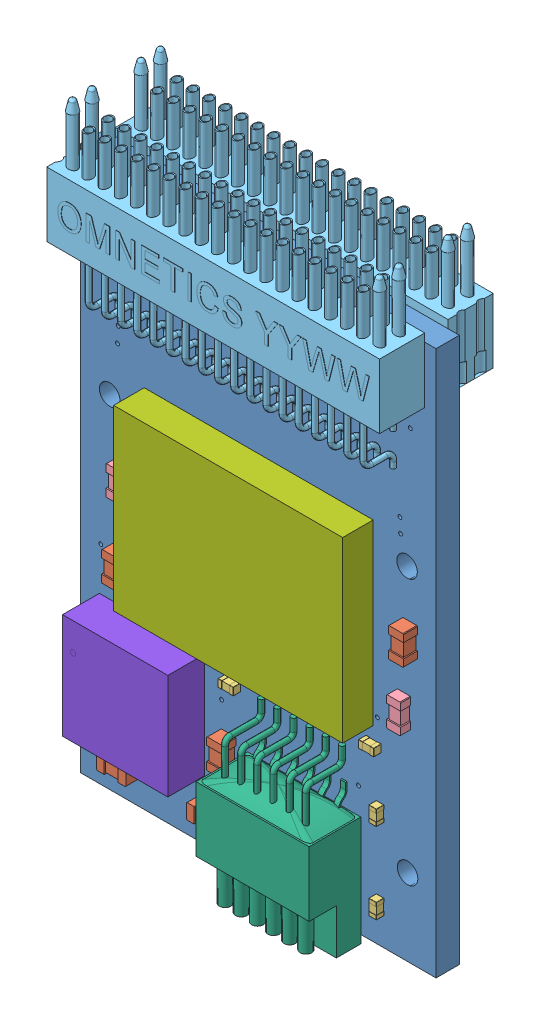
SolidWorks assembly RHD2164_accel_BGA.SLDASM, configuration Default (file format 15000). Lengths in mm.
Overall size (13.97 24.42 4.89).
17 component instances, 8 part files, 35 mates.
Components (placement in the parent):
- RHD2164_accel_bga_PCB-1: RHD2164_accel_bga_PCB.SLDPRT [Default] at origin size (13.97 21.42 0.91)
- 0402c_2320560-1: 0402c_2320560.sldprt [Default] at (12.9413 11.049 0.9144) x (0 1 0) z (0 0 1) size (1.15 0.6 0.55)
- 0402c_2320560-2: 0402c_2320560.sldprt [Default] at (1.6674 7.9992 0.9144) x (0 1 0) z (0 0 1) size (1.15 0.6 0.55)
- 0201c-1: 0201c.sldprt [0201] at (11.5189 6.7437 1.0644) size (0.6 0.3 0.3)
- 0402c_2320560-3: 0402c_2320560.sldprt [Default] at (1.7508 1.254 0.9144) size (1.15 0.6 0.55)
- 0402c_2320560-4: 0402c_2320560.sldprt [Default] at (5.801 3.6848 0.9144) x (0 -1 0) z (0 0 1) size (1.15 0.6 0.55)
- 0402c_2320560-5: 0402c_2320560.sldprt [Default] at (5.2814 1.331 0.9144) size (1.15 0.6 0.55)
- 0402r_1430758-1: 0402r_1430758.sldprt [Default] at (1.6637 10.8585 0.9144) x (0 1 0) z (0 0 1) size (1.15 0.55 0.4)
- 0402r_1430758-2: 0402r_1430758.sldprt [Default] at (12.7 8.509 0.9144) x (0 -1 0) z (0 0 1) size (1.15 0.55 0.4)
- 0201c-2: 0201c.sldprt [0201] at (5.9944 6.0579 1.0644) size (0.6 0.3 0.3)
- 0201c-3: 0201c.sldprt [0201] at (11.7729 1.397 1.0644) x (0 1 0) z (0 0 1) size (0.6 0.3 0.3)
- 0201c-4: 0201c.sldprt [0201] at (11.7729 4.572 1.0644) x (0 1 0) z (0 0 1) size (0.6 0.3 0.3)
- A79025-001-1: A79025-001.SLDPRT [Default] at (5.715 20.4672 2.6924) size (13.15 7.44 2.12)
- A79025-001-2: A79025-001.SLDPRT [Default] at (8.255 20.4672 -1.778) x (-1 0 0) z (0 0 -1) size (13.15 7.44 2.12)
- A79623-001-1: A79623-001.SLDPRT [Default] at (8.7884 4.0005 0.9144) x (1 0.000991 0) z (0.000991 -1 0) size (4.45 2.05 6.53)
- RHD2164_bga-1: RHD2164_bga.SLDPRT [Default] at (6.9977 10.8585 0.9144) size (9 7 1.2)
- ADXL335-1: ADXL335.SLDPRT [Default] at (2.8048 4.4074 0.8634) size (4.14 4.14 1.5)
Mates (geometry in assembly coordinates):
- Coincident1: coincident anti-aligned: plane of RHD2164_accel_bga-1 through (0 0 0.9144) normal (0 0 1); plane of RHD2164_bga-1 through (6.9977 10.8585 0.9144) normal (0 0 -1)
- Parallel1: parallel aligned: plane of RHD2164_accel_bga-1 through (13.97 21.4249 0.9144) normal (1 0 0); plane of RHD2164_bga-1 through (11.4977 7.3585 2.1144) normal (1 0 0)
- Coincident2: coincident anti-aligned: plane of RHD2164_accel_bga-1 through (0 0 0.9144) normal (0 0 1); plane of 0402r_1430758-1 through (0.8387 10.8585 0.9144) normal (0 0 -1)
- Parallel2: parallel aligned: plane of RHD2164_accel_bga-1 through (13.97 0 0.9144) normal (0 -1 0); plane of 0402r_1430758-1 through (1.4137 10.2835 1.3144) normal (0 -1 0)
- Coincident4: coincident anti-aligned: plane of RHD2164_accel_bga-1 through (0 0 0.9144) normal (0 0 1); plane of 0402c_2320560-2 through (0.8174 7.9992 0.9144) normal (0 0 -1)
- Parallel3: parallel aligned: plane of RHD2164_accel_bga-1 through (13.97 0 0.9144) normal (0 -1 0); plane of 0402c_2320560-2 through (1.3924 7.4242 1.4644) normal (0 -1 0)
- Coincident8: coincident aligned: plane of RHD2164_accel_bga-1 through (0 0 0.9144) normal (0 0 1); plane of ADXL335-1 through (0.7348 3.9044 0.9144) normal (0 0 1)
- Parallel4: parallel aligned: plane of RHD2164_accel_bga-1 through (13.97 0 0.9144) normal (0 -1 0); plane of ADXL335-1 through (0.7348 2.3374 0.9144) normal (0 -1 0)
- Coincident9: coincident anti-aligned: plane of RHD2164_accel_bga-1 through (0 0 0.9144) normal (0 0 1); plane of 0402c_2320560-3 through (1.7508 2.104 0.9144) normal (0 0 -1)
- Parallel5: parallel aligned: plane of RHD2164_accel_bga-1 through (0 0 0.9144) normal (-1 0 0); plane of 0402c_2320560-3 through (1.1758 1.529 1.4644) normal (-1 0 0)
- Coincident11: coincident anti-aligned: plane of RHD2164_accel_bga-1 through (0 0 0.9144) normal (0 0 1); plane of 0402c_2320560-5 through (5.2814 2.181 0.9144) normal (0 0 -1)
- Parallel6: parallel aligned: plane of RHD2164_accel_bga-1 through (0 0 0.9144) normal (-1 0 0); plane of 0402c_2320560-5 through (4.7064 1.606 1.4644) normal (-1 0 0)
- Coincident13: coincident anti-aligned: plane of RHD2164_accel_bga-1 through (0 0 0.9144) normal (0 0 1); plane of 0402c_2320560-4 through (6.651 3.6848 0.9144) normal (0 0 -1)
- Parallel7: parallel aligned: plane of RHD2164_accel_bga-1 through (13.97 0 0.9144) normal (0 -1 0); plane of 0402c_2320560-4 through (5.526 3.1098 1.4644) normal (0 -1 0)
- Coincident15: coincident anti-aligned: plane of RHD2164_accel_bga-1 through (0 0 0.9144) normal (0 0 1); plane of 0201c-2 through (6.2944 6.2079 0.9144) normal (0 0 -1)
- Parallel8: parallel aligned: plane of RHD2164_accel_bga-1 through (0 0 0.9144) normal (-1 0 0); plane of 0201c-2 through (5.6944 6.2079 0.9144) normal (-1 0 0)
- Coincident17: coincident anti-aligned: plane of RHD2164_accel_bga-1 through (0 0 0.9144) normal (0 0 1); plane of 0201c-3 through (11.6229 1.097 0.9144) normal (0 0 -1)
- Parallel9: parallel aligned: plane of RHD2164_accel_bga-1 through (13.97 0 0.9144) normal (0 -1 0); plane of 0201c-3 through (11.6229 1.097 0.9144) normal (0 -1 0)
- Coincident19: coincident anti-aligned: plane of RHD2164_accel_bga-1 through (0 0 0.9144) normal (0 0 1); plane of 0201c-4 through (11.6229 4.272 0.9144) normal (0 0 -1)
- Parallel10: parallel aligned: plane of RHD2164_accel_bga-1 through (13.97 0 0.9144) normal (0 -1 0); plane of 0201c-4 through (11.6229 4.272 0.9144) normal (0 -1 0)
- Coincident21: coincident anti-aligned: plane of RHD2164_accel_bga-1 through (0 0 0.9144) normal (0 0 1); plane of 0201c-1 through (11.8189 6.8937 0.9144) normal (0 0 -1)
- Parallel11: parallel aligned: plane of RHD2164_accel_bga-1 through (13.97 21.4249 0.9144) normal (1 0 0); plane of 0201c-1 through (11.8189 6.8937 0.9144) normal (1 0 0)
- Coincident23: coincident anti-aligned: plane of RHD2164_accel_bga-1 through (0 0 0.9144) normal (0 0 1); plane of 0402r_1430758-2 through (13.525 8.509 0.9144) normal (0 0 -1)
- Parallel12: parallel aligned: plane of RHD2164_accel_bga-1 through (13.97 0 0.9144) normal (0 -1 0); plane of 0402r_1430758-2 through (12.45 7.934 1.3144) normal (0 -1 0)
- Coincident25: coincident anti-aligned: plane of RHD2164_accel_bga-1 through (0 0 0.9144) normal (0 0 1); plane of 0402c_2320560-1 through (12.0913 11.049 0.9144) normal (0 0 -1)
- Parallel14: parallel aligned: plane of RHD2164_accel_bga-1 through (13.97 0 0.9144) normal (0 -1 0); plane of 0402c_2320560-1 through (12.6663 10.474 1.4644) normal (0 -1 0)
- Coincident28: coincident anti-aligned: plane of RHD2164_accel_bga-1 through (0 0 0.9144) normal (0 0 1); plane of A79623-001-1 through (8.7884 4.0005 0.9144) normal (0 0 -1)
- Coincident29: coincident anti-aligned: plane of RHD2164_accel_bga-1 through (0 0 0.9144) normal (0 0 1); plane of A79025-001-1 through (13.5255 19.1972 0.9144) normal (0 0 -1)
- Parallel15: parallel aligned: plane of RHD2164_accel_bga-1 through (13.97 21.4249 0.9144) normal (1 0 0); plane of A79025-001-1 through (13.5255 21.7372 2.6924) normal (1 0 0)
- Coincident31: coincident anti-aligned: plane of RHD2164_accel_bga-1 through (0 0 0) normal (0 0 -1); plane of A79025-001-2 through (0.4445 19.1972 0) normal (0 0 1)
- Parallel16: parallel aligned: plane of RHD2164_accel_bga-1 through (0 0 0.9144) normal (-1 0 0); plane of A79025-001-2 through (0.4445 21.7372 -1.778) normal (-1 0 0)
- Distance1: distance = 0.4445 mm: line of A79025-001-2 through (2.54 0.4445 21.7372) axis (0 0 -1); line of RHD2164_accel_bga-1 through (21.4249 0 21.4249) axis (0 0 -1)
- Distance2: distance = 0.4445 mm: line of A79025-001-1 through (13.5255 21.7372 0.9144) axis (0 -1 0); line of RHD2164_accel_bga-1 through (13.97 0 0.9144) axis (0 1 0)
- Distance4: distance = 7.3787 mm: line of RHD2164_bga-1 through (11.4977 14.3585 0.9144) axis (-1 0 0); line of A79025-001-1 through (0.4445 21.7372 0.9144) axis (1 0 0)
- Coincident38: coincident aligned: plane of A79025-001-1 through (13.5255 21.7372 2.6924) normal (0 1 0); plane of A79025-001-2 through (0.4445 21.7372 -1.778) normal (0 1 0)
